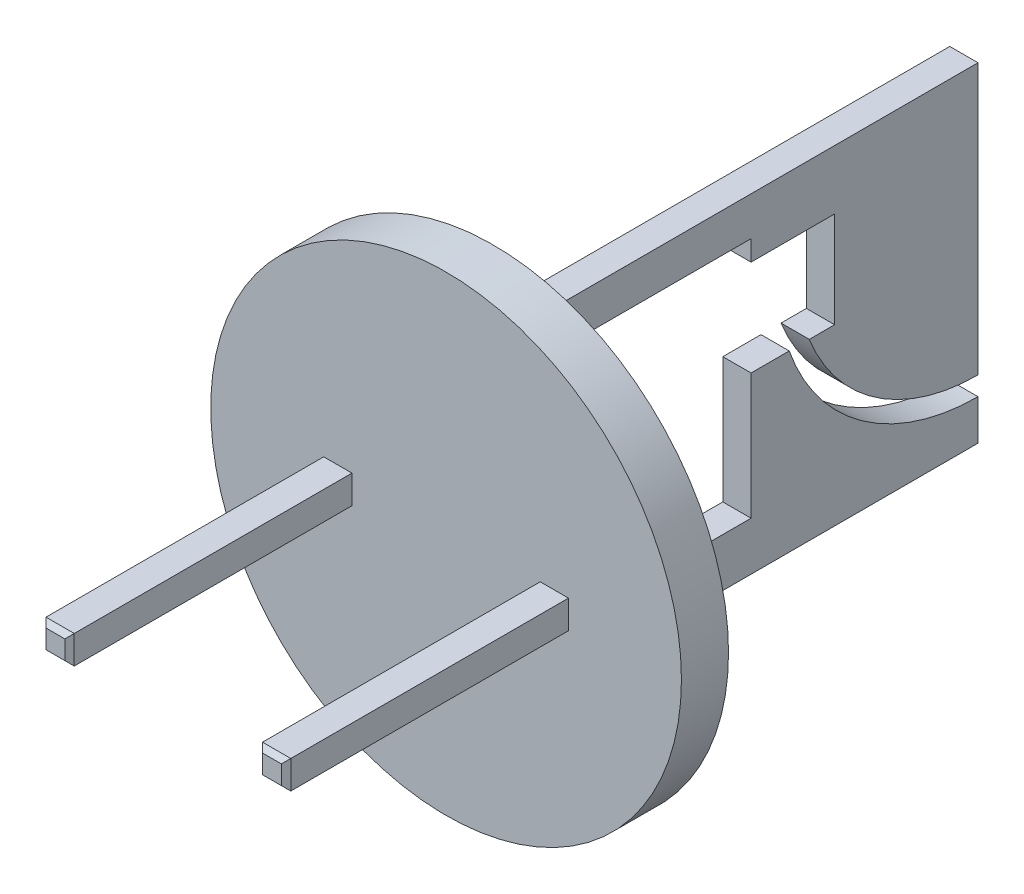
from build123d import *

# Parameters (mm, degrees)
ESQUISSE2_R             = 2.5
EXTRUSION1_DEPTH        = 0.5
ESQUISSE3_W             = 0.3
ESQUISSE3_H             = 3.5
EXTRUSION2_DEPTH        = 5
ENL_V_MAT_EXTRU_2_DEPTH = 7.597158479
ESQUISSE5_W             = 0.3
ESQUISSE5_H             = 0.3
EXTRUSION3_DEPTH        = 3
CHANFREIN1_SIZE         = 0.05


with BuildPart() as part:
    # Esquisse2 → Extrusion1 (new body)
    with BuildSketch(Plane.XY):
        Circle(ESQUISSE2_R)
    extrude(amount=-EXTRUSION1_DEPTH)

    # Esquisse3 → Extrusion2 (add)
    with BuildSketch(Plane(origin=(0, 0, -0.5), x_dir=(-1, 0, 0), z_dir=(0, 0, -1))):
        Rectangle(ESQUISSE3_W, ESQUISSE3_H)
    extrude(amount=EXTRUSION2_DEPTH)

    # Esquisse4 → Enl_v. mat.-Extru.2 (cut, through all)
    with BuildSketch(Plane(origin=(0.15, 0, 0), x_dir=(0, 0, -1), z_dir=(1, 0, 0))):
        with BuildLine():
            Line((3.707972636, 0.101539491), (3.976907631, 0.101539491))
            Line((3.976907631, 0.101539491), (3.976907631, 1.1208166))
            Line((3.976907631, 1.1208166), (3.08935743, 1.1208166))
            Line((3.08935743, 1.1208166), (3.08935743, 1.337014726))
            Line((3.08935743, 1.337014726), (0.5, 1.337014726))
            Line((0.5, 1.337014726), (0.5, -1.234605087))
            Line((0.5, -1.234605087), (3.08935743, -1.234605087))
            Line((3.08935743, -1.234605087), (3.08935743, 0.101539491))
            Line((3.08935743, 0.101539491), (3.494752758, 0.101539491))
            ThreePointArc((3.494752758, 0.101539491), (4.270439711, -0.929881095), (5.5, -1.321927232))
            Line((5.5, -1.321927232), (5.5, -1.121927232))
            ThreePointArc((5.5, -1.121927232), (4.415076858, -0.786891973), (3.707972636, 0.101539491))
        make_face()
    extrude(amount=-ENL_V_MAT_EXTRU_2_DEPTH, mode=Mode.SUBTRACT)

    # Esquisse5 → Extrusion3 (add)
    with BuildSketch(Plane.XY):
        with Locations((-1.15, 0)):
            Rectangle(ESQUISSE5_W, ESQUISSE5_H)
        with Locations((1.15, 0)):
            Rectangle(ESQUISSE5_W, ESQUISSE5_H)
    extrude(amount=EXTRUSION3_DEPTH)

    # Chanfrein1
    chanfrein1_edges = [part.edges().sort_by_distance(p)[0] for p in [
        (-1.3, 0, 3),
        (-1.15, -0.15, 3),
        (-1, 0, 3),
        (-1.15, 0.15, 3),
        (1.15, 0.15, 3),
        (1, 0, 3),
        (1.15, -0.15, 3),
        (1.3, 0, 3),
    ]]
    chamfer(chanfrein1_edges, length=CHANFREIN1_SIZE)


solid = part.part
